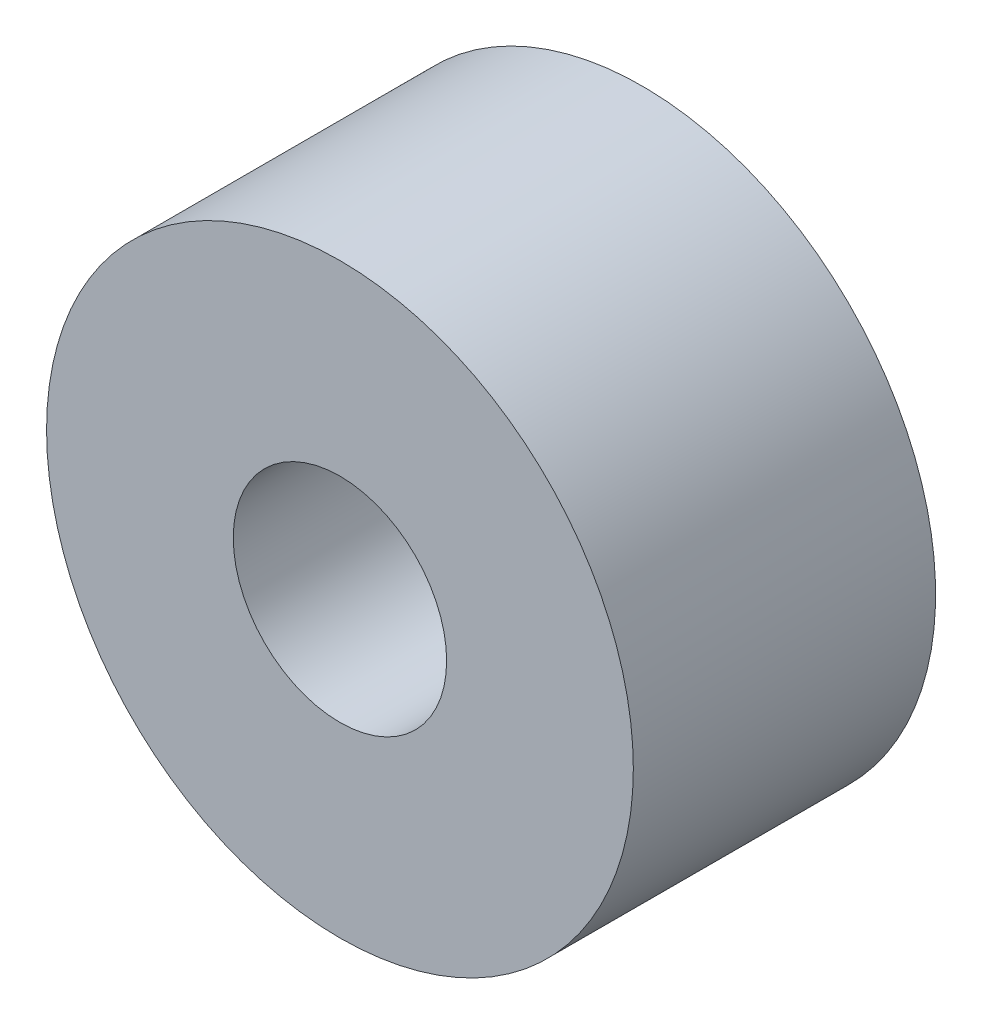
ISO-10303-21;
HEADER;
FILE_DESCRIPTION(('STEP AP214'),'2;1');
FILE_NAME('part.step','',(''),(''),'','','');
FILE_SCHEMA(('AUTOMOTIVE_DESIGN { 1 0 10303 214 1 1 1 1 }'));
ENDSEC;
DATA;
#1=APPLICATION_CONTEXT('core data for automotive mechanical design processes');
#2=APPLICATION_PROTOCOL_DEFINITION('international standard','automotive_design',2000,#1);
#3=PRODUCT_CONTEXT('',#1,'mechanical');
#4=PRODUCT('Part','Part','',(#3));
#5=PRODUCT_RELATED_PRODUCT_CATEGORY('part','',(#4));
#6=PRODUCT_DEFINITION_FORMATION('','',#4);
#7=PRODUCT_DEFINITION_CONTEXT('part definition',#1,'design');
#8=PRODUCT_DEFINITION('design','',#6,#7);
#9=PRODUCT_DEFINITION_SHAPE('','',#8);
#10=(LENGTH_UNIT() NAMED_UNIT(*) SI_UNIT(.MILLI.,.METRE.));
#11=(NAMED_UNIT(*) PLANE_ANGLE_UNIT() SI_UNIT($,.RADIAN.));
#12=(NAMED_UNIT(*) SI_UNIT($,.STERADIAN.) SOLID_ANGLE_UNIT());
#13=UNCERTAINTY_MEASURE_WITH_UNIT(LENGTH_MEASURE(1.E-05),#10,'distance_accuracy_value','');
#14=(GEOMETRIC_REPRESENTATION_CONTEXT(3) GLOBAL_UNCERTAINTY_ASSIGNED_CONTEXT((#13)) GLOBAL_UNIT_ASSIGNED_CONTEXT((#10,
#11,#12)) REPRESENTATION_CONTEXT('',''));
#15=CARTESIAN_POINT('',(0.,0.,0.));
#16=DIRECTION('',(0.,0.,1.));
#17=DIRECTION('',(1.,0.,0.));
#18=AXIS2_PLACEMENT_3D('',#15,#16,#17);
#19=CARTESIAN_POINT('',(360.,-290.,165.));
#20=DIRECTION('',(0.,0.,-1.));
#21=DIRECTION('',(-1.,0.,0.));
#22=AXIS2_PLACEMENT_3D('',#19,#20,#21);
#23=CYLINDRICAL_SURFACE('',#22,16.5);
#24=CARTESIAN_POINT('',(360.,-290.,165.));
#25=DIRECTION('',(0.,0.,1.));
#26=DIRECTION('',(1.,0.,0.));
#27=AXIS2_PLACEMENT_3D('',#24,#25,#26);
#28=CIRCLE('',#27,16.5);
#29=CARTESIAN_POINT('',(376.5,-290.,165.));
#30=VERTEX_POINT('',#29);
#31=EDGE_CURVE('E10',#30,#30,#28,.T.);
#32=ORIENTED_EDGE('',*,*,#31,.F.);
#33=EDGE_LOOP('',(#32));
#34=FACE_BOUND('',#33,.T.);
#35=CARTESIAN_POINT('',(360.,-290.,148.));
#36=DIRECTION('',(0.,0.,-1.));
#37=DIRECTION('',(-1.,0.,0.));
#38=AXIS2_PLACEMENT_3D('',#35,#36,#37);
#39=CIRCLE('',#38,16.5);
#40=CARTESIAN_POINT('',(343.5,-290.,148.));
#41=VERTEX_POINT('',#40);
#42=EDGE_CURVE('E41',#41,#41,#39,.T.);
#43=ORIENTED_EDGE('',*,*,#42,.F.);
#44=EDGE_LOOP('',(#43));
#45=FACE_BOUND('',#44,.T.);
#46=ADVANCED_FACE('F28',(#34,#45),#23,.T.);
#47=CARTESIAN_POINT('',(360.,-290.,165.));
#48=DIRECTION('',(0.,0.,-1.));
#49=DIRECTION('',(-1.,0.,0.));
#50=AXIS2_PLACEMENT_3D('',#47,#48,#49);
#51=CYLINDRICAL_SURFACE('',#50,5.99999999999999);
#52=CARTESIAN_POINT('',(360.,-290.,165.));
#53=DIRECTION('',(0.,0.,1.));
#54=DIRECTION('',(1.,0.,0.));
#55=AXIS2_PLACEMENT_3D('',#52,#53,#54);
#56=CIRCLE('',#55,5.99999999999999);
#57=CARTESIAN_POINT('',(366.,-290.,165.));
#58=VERTEX_POINT('',#57);
#59=EDGE_CURVE('E35',#58,#58,#56,.T.);
#60=ORIENTED_EDGE('',*,*,#59,.T.);
#61=EDGE_LOOP('',(#60));
#62=FACE_BOUND('',#61,.T.);
#63=CARTESIAN_POINT('',(360.,-290.,148.));
#64=DIRECTION('',(0.,0.,-1.));
#65=DIRECTION('',(-1.,0.,0.));
#66=AXIS2_PLACEMENT_3D('',#63,#64,#65);
#67=CIRCLE('',#66,5.99999999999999);
#68=CARTESIAN_POINT('',(354.,-290.,148.));
#69=VERTEX_POINT('',#68);
#70=EDGE_CURVE('E31',#69,#69,#67,.T.);
#71=ORIENTED_EDGE('',*,*,#70,.T.);
#72=EDGE_LOOP('',(#71));
#73=FACE_BOUND('',#72,.T.);
#74=ADVANCED_FACE('F48',(#62,#73),#51,.F.);
#75=CARTESIAN_POINT('',(360.,-290.,165.));
#76=DIRECTION('',(0.,0.,1.));
#77=DIRECTION('',(1.,0.,0.));
#78=AXIS2_PLACEMENT_3D('',#75,#76,#77);
#79=PLANE('',#78);
#80=ORIENTED_EDGE('',*,*,#31,.T.);
#81=EDGE_LOOP('',(#80));
#82=FACE_BOUND('',#81,.T.);
#83=ORIENTED_EDGE('',*,*,#59,.F.);
#84=EDGE_LOOP('',(#83));
#85=FACE_BOUND('',#84,.T.);
#86=ADVANCED_FACE('F52',(#82,#85),#79,.T.);
#87=CARTESIAN_POINT('',(360.,-290.,148.));
#88=DIRECTION('',(0.,0.,-1.));
#89=DIRECTION('',(-1.,0.,0.));
#90=AXIS2_PLACEMENT_3D('',#87,#88,#89);
#91=PLANE('',#90);
#92=ORIENTED_EDGE('',*,*,#70,.F.);
#93=EDGE_LOOP('',(#92));
#94=FACE_BOUND('',#93,.T.);
#95=ORIENTED_EDGE('',*,*,#42,.T.);
#96=EDGE_LOOP('',(#95));
#97=FACE_BOUND('',#96,.T.);
#98=ADVANCED_FACE('F50',(#94,#97),#91,.T.);
#99=CLOSED_SHELL('',(#46,#74,#86,#98));
#100=MANIFOLD_SOLID_BREP('B2',#99);
#101=ADVANCED_BREP_SHAPE_REPRESENTATION('',(#18,#100),#14);
#102=SHAPE_DEFINITION_REPRESENTATION(#9,#101);
ENDSEC;
END-ISO-10303-21;
